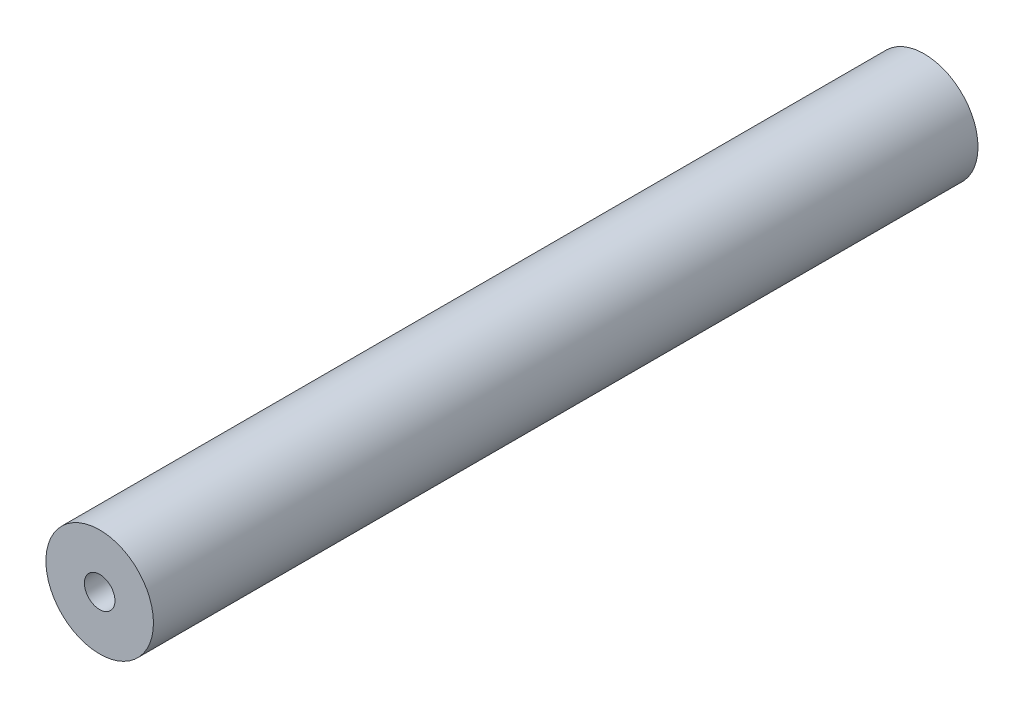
from build123d import *

# Parameters (mm, degrees)
SKETCH1_R                   = 9.525
BOSS_EXTRUDE1_DEPTH         = 73.025
F_1_4_28_TAPPED_HOLE1_D     = 5.4102
F_1_4_28_TAPPED_HOLE1_DEPTH = 23.5966
F_1_4_28_TAPPED_HOLE1_TIP   = 1.625388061
F_1_4_28_TAPPED_HOLE2_D     = 5.4102
F_1_4_28_TAPPED_HOLE2_DEPTH = 23.5966
F_1_4_28_TAPPED_HOLE2_TIP   = 1.625388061


with BuildPart() as part:
    # Sketch1 → Boss-Extrude1 (new, symmetric)
    with BuildSketch(Plane.XY):
        Circle(SKETCH1_R)
    extrude(amount=BOSS_EXTRUDE1_DEPTH, both=True)

    # 1_4-28 Tapped Hole1
    with Locations(Plane.XY.offset(73.025)):
        with Locations((0, 0)):
            Hole(F_1_4_28_TAPPED_HOLE1_D / 2, depth=F_1_4_28_TAPPED_HOLE1_DEPTH)
            with Locations((0, 0, -(F_1_4_28_TAPPED_HOLE1_DEPTH + F_1_4_28_TAPPED_HOLE1_TIP / 2))):  # 118° drill point
                Cone(0, F_1_4_28_TAPPED_HOLE1_D / 2, F_1_4_28_TAPPED_HOLE1_TIP, mode=Mode.SUBTRACT)

    # 1_4-28 Tapped Hole2
    with Locations(Plane(origin=(0, 0, -73.025), x_dir=(-1, 0, 0), z_dir=(0, 0, -1))):
        with Locations((0, 0)):
            Hole(F_1_4_28_TAPPED_HOLE2_D / 2, depth=F_1_4_28_TAPPED_HOLE2_DEPTH)
            with Locations((0, 0, -(F_1_4_28_TAPPED_HOLE2_DEPTH + F_1_4_28_TAPPED_HOLE2_TIP / 2))):  # 118° drill point
                Cone(0, F_1_4_28_TAPPED_HOLE2_D / 2, F_1_4_28_TAPPED_HOLE2_TIP, mode=Mode.SUBTRACT)


solid = part.part
